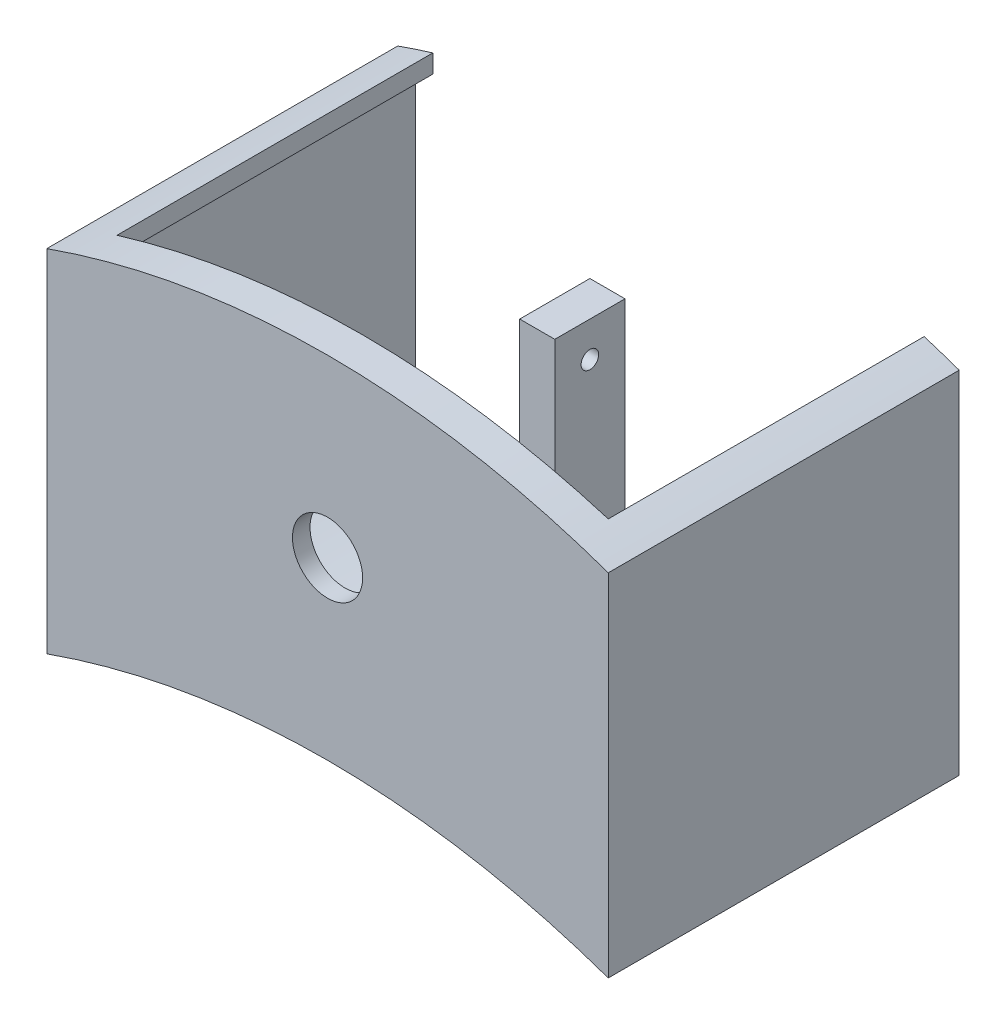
ISO-10303-21;
HEADER;
FILE_DESCRIPTION(('STEP AP214'),'2;1');
FILE_NAME('part.step','',(''),(''),'','','');
FILE_SCHEMA(('AUTOMOTIVE_DESIGN { 1 0 10303 214 1 1 1 1 }'));
ENDSEC;
DATA;
#1=APPLICATION_CONTEXT('core data for automotive mechanical design processes');
#2=APPLICATION_PROTOCOL_DEFINITION('international standard','automotive_design',2000,#1);
#3=PRODUCT_CONTEXT('',#1,'mechanical');
#4=PRODUCT('Part','Part','',(#3));
#5=PRODUCT_RELATED_PRODUCT_CATEGORY('part','',(#4));
#6=PRODUCT_DEFINITION_FORMATION('','',#4);
#7=PRODUCT_DEFINITION_CONTEXT('part definition',#1,'design');
#8=PRODUCT_DEFINITION('design','',#6,#7);
#9=PRODUCT_DEFINITION_SHAPE('','',#8);
#10=(LENGTH_UNIT() NAMED_UNIT(*) SI_UNIT(.MILLI.,.METRE.));
#11=(NAMED_UNIT(*) PLANE_ANGLE_UNIT() SI_UNIT($,.RADIAN.));
#12=(NAMED_UNIT(*) SI_UNIT($,.STERADIAN.) SOLID_ANGLE_UNIT());
#13=UNCERTAINTY_MEASURE_WITH_UNIT(LENGTH_MEASURE(1.E-05),#10,'distance_accuracy_value','');
#14=(GEOMETRIC_REPRESENTATION_CONTEXT(3) GLOBAL_UNCERTAINTY_ASSIGNED_CONTEXT((#13)) GLOBAL_UNIT_ASSIGNED_CONTEXT((#10,
#11,#12)) REPRESENTATION_CONTEXT('',''));
#15=CARTESIAN_POINT('',(0.,0.,0.));
#16=DIRECTION('',(0.,0.,1.));
#17=DIRECTION('',(1.,0.,0.));
#18=AXIS2_PLACEMENT_3D('',#15,#16,#17);
#19=CARTESIAN_POINT('',(25.4,-71.8420489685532,31.75));
#20=DIRECTION('',(0.,0.,-1.));
#21=DIRECTION('',(-1.,0.,0.));
#22=AXIS2_PLACEMENT_3D('',#19,#20,#21);
#23=CYLINDRICAL_SURFACE('',#22,76.2);
#24=DIRECTION('',(0.,0.,-1.));
#25=VECTOR('',#24,1.);
#26=CARTESIAN_POINT('',(50.8,0.,31.75));
#27=LINE('',#26,#25);
#28=CARTESIAN_POINT('',(50.8,0.,31.75));
#29=VERTEX_POINT('',#28);
#30=CARTESIAN_POINT('',(50.8,0.,0.));
#31=VERTEX_POINT('',#30);
#32=EDGE_CURVE('E261',#29,#31,#27,.T.);
#33=ORIENTED_EDGE('',*,*,#32,.F.);
#34=CARTESIAN_POINT('',(25.4,-71.8420489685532,31.75));
#35=DIRECTION('',(0.,0.,-1.));
#36=DIRECTION('',(1.,0.,0.));
#37=AXIS2_PLACEMENT_3D('',#34,#35,#36);
#38=CIRCLE('',#37,76.2);
#39=CARTESIAN_POINT('',(0.,0.,31.75));
#40=VERTEX_POINT('',#39);
#41=EDGE_CURVE('E234',#40,#29,#38,.T.);
#42=ORIENTED_EDGE('',*,*,#41,.F.);
#43=DIRECTION('',(0.,0.,-1.));
#44=VECTOR('',#43,1.);
#45=CARTESIAN_POINT('',(0.,0.,31.75));
#46=LINE('',#45,#44);
#47=CARTESIAN_POINT('',(0.,0.,0.));
#48=VERTEX_POINT('',#47);
#49=EDGE_CURVE('E243',#40,#48,#46,.T.);
#50=ORIENTED_EDGE('',*,*,#49,.T.);
#51=CARTESIAN_POINT('',(25.4,-71.8420489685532,0.));
#52=DIRECTION('',(0.,0.,-1.));
#53=DIRECTION('',(1.,0.,0.));
#54=AXIS2_PLACEMENT_3D('',#51,#52,#53);
#55=CIRCLE('',#54,76.2);
#56=EDGE_CURVE('E233',#48,#31,#55,.T.);
#57=ORIENTED_EDGE('',*,*,#56,.T.);
#58=EDGE_LOOP('',(#33,#42,#50,#57));
#59=FACE_BOUND('',#58,.T.);
#60=ADVANCED_FACE('F32',(#59),#23,.F.);
#61=CARTESIAN_POINT('',(25.4,-71.8420489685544,30.1625));
#62=DIRECTION('',(0.,0.,-1.));
#63=DIRECTION('',(-1.,0.,0.));
#64=AXIS2_PLACEMENT_3D('',#61,#62,#63);
#65=CYLINDRICAL_SURFACE('',#64,77.7875000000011);
#66=CARTESIAN_POINT('',(25.4,-71.8420489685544,0.));
#67=DIRECTION('',(0.,0.,-1.));
#68=DIRECTION('',(1.,0.,0.));
#69=AXIS2_PLACEMENT_3D('',#66,#67,#68);
#70=CIRCLE('',#69,77.7875000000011);
#71=CARTESIAN_POINT('',(1.58750000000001,2.21104009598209,0.));
#72=VERTEX_POINT('',#71);
#73=CARTESIAN_POINT('',(49.2125,2.21104009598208,0.));
#74=VERTEX_POINT('',#73);
#75=EDGE_CURVE('E219',#72,#74,#70,.T.);
#76=ORIENTED_EDGE('',*,*,#75,.F.);
#77=DIRECTION('',(0.,0.,-1.));
#78=VECTOR('',#77,1.);
#79=CARTESIAN_POINT('',(1.58750000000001,2.21104009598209,30.1625));
#80=LINE('',#79,#78);
#81=CARTESIAN_POINT('',(1.58750000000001,2.21104009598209,30.1625));
#82=VERTEX_POINT('',#81);
#83=EDGE_CURVE('E228',#82,#72,#80,.T.);
#84=ORIENTED_EDGE('',*,*,#83,.F.);
#85=CARTESIAN_POINT('',(25.4,-71.8420489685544,30.1625));
#86=DIRECTION('',(0.,0.,-1.));
#87=DIRECTION('',(1.,0.,0.));
#88=AXIS2_PLACEMENT_3D('',#85,#86,#87);
#89=CIRCLE('',#88,77.7875000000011);
#90=CARTESIAN_POINT('',(49.2125,2.21104009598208,30.1625));
#91=VERTEX_POINT('',#90);
#92=EDGE_CURVE('E207',#82,#91,#89,.T.);
#93=ORIENTED_EDGE('',*,*,#92,.T.);
#94=DIRECTION('',(0.,0.,-1.));
#95=VECTOR('',#94,1.);
#96=CARTESIAN_POINT('',(49.2125,2.21104009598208,30.1625));
#97=LINE('',#96,#95);
#98=EDGE_CURVE('E226',#91,#74,#97,.T.);
#99=ORIENTED_EDGE('',*,*,#98,.T.);
#100=EDGE_LOOP('',(#76,#84,#93,#99));
#101=FACE_BOUND('',#100,.T.);
#102=CARTESIAN_POINT('',(25.4,-71.8420489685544,3.175));
#103=DIRECTION('',(0.,0.,1.));
#104=DIRECTION('',(1.,0.,0.));
#105=AXIS2_PLACEMENT_3D('',#102,#103,#104);
#106=CIRCLE('',#105,77.7875000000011);
#107=CARTESIAN_POINT('',(20.5613,5.79481172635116,3.175));
#108=VERTEX_POINT('',#107);
#109=CARTESIAN_POINT('',(23.7363,5.92765759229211,3.175));
#110=VERTEX_POINT('',#109);
#111=EDGE_CURVE('E39',#108,#110,#106,.F.);
#112=ORIENTED_EDGE('',*,*,#111,.T.);
#113=DIRECTION('',(0.,0.,-1.));
#114=VECTOR('',#113,1.);
#115=CARTESIAN_POINT('',(23.7363,5.92765759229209,30.1625));
#116=LINE('',#115,#114);
#117=CARTESIAN_POINT('',(23.7363,5.92765759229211,9.525));
#118=VERTEX_POINT('',#117);
#119=EDGE_CURVE('E12',#110,#118,#116,.F.);
#120=ORIENTED_EDGE('',*,*,#119,.T.);
#121=CARTESIAN_POINT('',(25.4,-71.8420489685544,9.525));
#122=DIRECTION('',(0.,0.,-1.));
#123=DIRECTION('',(-1.,0.,0.));
#124=AXIS2_PLACEMENT_3D('',#121,#122,#123);
#125=CIRCLE('',#124,77.7875000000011);
#126=CARTESIAN_POINT('',(20.5613,5.79481172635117,9.525));
#127=VERTEX_POINT('',#126);
#128=EDGE_CURVE('E272',#118,#127,#125,.F.);
#129=ORIENTED_EDGE('',*,*,#128,.T.);
#130=DIRECTION('',(0.,0.,-1.));
#131=VECTOR('',#130,1.);
#132=CARTESIAN_POINT('',(20.5613,5.79481172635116,30.1625));
#133=LINE('',#132,#131);
#134=EDGE_CURVE('E275',#127,#108,#133,.T.);
#135=ORIENTED_EDGE('',*,*,#134,.T.);
#136=EDGE_LOOP('',(#112,#120,#129,#135));
#137=FACE_BOUND('',#136,.T.);
#138=ADVANCED_FACE('F278',(#101,#137),#65,.T.);
#139=CARTESIAN_POINT('',(25.4,-71.8420489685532,0.));
#140=DIRECTION('',(0.,0.,1.));
#141=DIRECTION('',(1.,0.,0.));
#142=AXIS2_PLACEMENT_3D('',#139,#140,#141);
#143=PLANE('',#142);
#144=CARTESIAN_POINT('',(25.4,-40.0920489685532,0.));
#145=DIRECTION('',(0.,0.,1.));
#146=DIRECTION('',(1.,0.,0.));
#147=AXIS2_PLACEMENT_3D('',#144,#145,#146);
#148=CIRCLE('',#147,76.2);
#149=CARTESIAN_POINT('',(3.175,32.7947768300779,0.));
#150=VERTEX_POINT('',#149);
#151=CARTESIAN_POINT('',(0.,31.75,0.));
#152=VERTEX_POINT('',#151);
#153=EDGE_CURVE('E248',#150,#152,#148,.T.);
#154=ORIENTED_EDGE('',*,*,#153,.F.);
#155=DIRECTION('',(0.,-1.,0.));
#156=VECTOR('',#155,1.);
#157=CARTESIAN_POINT('',(3.175,28.7581986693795,0.));
#158=LINE('',#157,#156);
#159=CARTESIAN_POINT('',(3.175,31.133469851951,0.));
#160=VERTEX_POINT('',#159);
#161=EDGE_CURVE('E170',#150,#160,#158,.T.);
#162=ORIENTED_EDGE('',*,*,#161,.T.);
#163=CARTESIAN_POINT('',(25.4,-40.0920489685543,0.));
#164=DIRECTION('',(0.,0.,1.));
#165=DIRECTION('',(1.,0.,0.));
#166=AXIS2_PLACEMENT_3D('',#163,#164,#165);
#167=CIRCLE('',#166,74.612500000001);
#168=CARTESIAN_POINT('',(1.5875,30.618558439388,0.));
#169=VERTEX_POINT('',#168);
#170=EDGE_CURVE('E216',#160,#169,#167,.T.);
#171=ORIENTED_EDGE('',*,*,#170,.T.);
#172=DIRECTION('',(0.,-1.,0.));
#173=VECTOR('',#172,1.);
#174=CARTESIAN_POINT('',(1.5875,2.21104009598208,0.));
#175=LINE('',#174,#173);
#176=EDGE_CURVE('E215',#169,#72,#175,.T.);
#177=ORIENTED_EDGE('',*,*,#176,.T.);
#178=ORIENTED_EDGE('',*,*,#75,.T.);
#179=DIRECTION('',(0.,1.,0.));
#180=VECTOR('',#179,1.);
#181=CARTESIAN_POINT('',(49.2125,2.21104009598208,0.));
#182=LINE('',#181,#180);
#183=CARTESIAN_POINT('',(49.2125,30.618558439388,0.));
#184=VERTEX_POINT('',#183);
#185=EDGE_CURVE('E205',#74,#184,#182,.T.);
#186=ORIENTED_EDGE('',*,*,#185,.T.);
#187=CARTESIAN_POINT('',(47.625,31.133469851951,0.));
#188=VERTEX_POINT('',#187);
#189=EDGE_CURVE('E212',#184,#188,#167,.T.);
#190=ORIENTED_EDGE('',*,*,#189,.T.);
#191=DIRECTION('',(0.,1.,0.));
#192=VECTOR('',#191,1.);
#193=CARTESIAN_POINT('',(47.625,28.7581986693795,0.));
#194=LINE('',#193,#192);
#195=CARTESIAN_POINT('',(47.625,32.7947768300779,0.));
#196=VERTEX_POINT('',#195);
#197=EDGE_CURVE('E54',#188,#196,#194,.T.);
#198=ORIENTED_EDGE('',*,*,#197,.T.);
#199=CARTESIAN_POINT('',(50.8,31.75,0.));
#200=VERTEX_POINT('',#199);
#201=EDGE_CURVE('E249',#200,#196,#148,.T.);
#202=ORIENTED_EDGE('',*,*,#201,.F.);
#203=DIRECTION('',(0.,1.,0.));
#204=VECTOR('',#203,1.);
#205=CARTESIAN_POINT('',(50.8,0.,0.));
#206=LINE('',#205,#204);
#207=EDGE_CURVE('E246',#31,#200,#206,.T.);
#208=ORIENTED_EDGE('',*,*,#207,.F.);
#209=ORIENTED_EDGE('',*,*,#56,.F.);
#210=DIRECTION('',(0.,-1.,0.));
#211=VECTOR('',#210,1.);
#212=CARTESIAN_POINT('',(0.,0.,0.));
#213=LINE('',#212,#211);
#214=EDGE_CURVE('E237',#152,#48,#213,.T.);
#215=ORIENTED_EDGE('',*,*,#214,.F.);
#216=EDGE_LOOP('',(#154,#162,#171,#177,#178,#186,#190,#198,#202,#208,#209,#215));
#217=FACE_BOUND('',#216,.T.);
#218=ADVANCED_FACE('F301',(#217),#143,.F.);
#219=CARTESIAN_POINT('',(50.8,0.,31.75));
#220=DIRECTION('',(-1.,0.,0.));
#221=DIRECTION('',(0.,0.,1.));
#222=AXIS2_PLACEMENT_3D('',#219,#220,#221);
#223=PLANE('',#222);
#224=ORIENTED_EDGE('',*,*,#207,.T.);
#225=DIRECTION('',(0.,0.,-1.));
#226=VECTOR('',#225,1.);
#227=CARTESIAN_POINT('',(50.8,31.75,31.75));
#228=LINE('',#227,#226);
#229=CARTESIAN_POINT('',(50.8,31.75,31.75));
#230=VERTEX_POINT('',#229);
#231=EDGE_CURVE('E258',#230,#200,#228,.T.);
#232=ORIENTED_EDGE('',*,*,#231,.F.);
#233=DIRECTION('',(0.,1.,0.));
#234=VECTOR('',#233,1.);
#235=CARTESIAN_POINT('',(50.8,0.,31.75));
#236=LINE('',#235,#234);
#237=EDGE_CURVE('E236',#29,#230,#236,.T.);
#238=ORIENTED_EDGE('',*,*,#237,.F.);
#239=ORIENTED_EDGE('',*,*,#32,.T.);
#240=EDGE_LOOP('',(#224,#232,#238,#239));
#241=FACE_BOUND('',#240,.T.);
#242=ADVANCED_FACE('F309',(#241),#223,.F.);
#243=CARTESIAN_POINT('',(25.4,-40.0920489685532,31.75));
#244=DIRECTION('',(0.,0.,-1.));
#245=DIRECTION('',(-1.,0.,0.));
#246=AXIS2_PLACEMENT_3D('',#243,#244,#245);
#247=CYLINDRICAL_SURFACE('',#246,76.2);
#248=CARTESIAN_POINT('',(25.4,-40.0920489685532,28.575));
#249=DIRECTION('',(0.,0.,1.));
#250=DIRECTION('',(1.,0.,0.));
#251=AXIS2_PLACEMENT_3D('',#248,#249,#250);
#252=CIRCLE('',#251,76.2);
#253=CARTESIAN_POINT('',(47.625,32.7947768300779,28.575));
#254=VERTEX_POINT('',#253);
#255=CARTESIAN_POINT('',(3.175,32.7947768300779,28.575));
#256=VERTEX_POINT('',#255);
#257=EDGE_CURVE('E194',#254,#256,#252,.T.);
#258=ORIENTED_EDGE('',*,*,#257,.T.);
#259=DIRECTION('',(0.,0.,-1.));
#260=VECTOR('',#259,1.);
#261=CARTESIAN_POINT('',(3.175,32.7947768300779,31.75));
#262=LINE('',#261,#260);
#263=EDGE_CURVE('E186',#256,#150,#262,.T.);
#264=ORIENTED_EDGE('',*,*,#263,.T.);
#265=ORIENTED_EDGE('',*,*,#153,.T.);
#266=DIRECTION('',(0.,0.,-1.));
#267=VECTOR('',#266,1.);
#268=CARTESIAN_POINT('',(0.,31.75,31.75));
#269=LINE('',#268,#267);
#270=CARTESIAN_POINT('',(0.,31.75,31.75));
#271=VERTEX_POINT('',#270);
#272=EDGE_CURVE('E255',#271,#152,#269,.T.);
#273=ORIENTED_EDGE('',*,*,#272,.F.);
#274=CARTESIAN_POINT('',(25.4,-40.0920489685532,31.75));
#275=DIRECTION('',(0.,0.,1.));
#276=DIRECTION('',(1.,0.,0.));
#277=AXIS2_PLACEMENT_3D('',#274,#275,#276);
#278=CIRCLE('',#277,76.2);
#279=EDGE_CURVE('E239',#230,#271,#278,.T.);
#280=ORIENTED_EDGE('',*,*,#279,.F.);
#281=ORIENTED_EDGE('',*,*,#231,.T.);
#282=ORIENTED_EDGE('',*,*,#201,.T.);
#283=DIRECTION('',(0.,0.,-1.));
#284=VECTOR('',#283,1.);
#285=CARTESIAN_POINT('',(47.625,32.7947768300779,31.75));
#286=LINE('',#285,#284);
#287=EDGE_CURVE('E182',#196,#254,#286,.F.);
#288=ORIENTED_EDGE('',*,*,#287,.T.);
#289=EDGE_LOOP('',(#258,#264,#265,#273,#280,#281,#282,#288));
#290=FACE_BOUND('',#289,.T.);
#291=ADVANCED_FACE('F324',(#290),#247,.T.);
#292=CARTESIAN_POINT('',(0.,0.,31.75));
#293=DIRECTION('',(1.,0.,0.));
#294=DIRECTION('',(0.,0.,-1.));
#295=AXIS2_PLACEMENT_3D('',#292,#293,#294);
#296=PLANE('',#295);
#297=ORIENTED_EDGE('',*,*,#214,.T.);
#298=ORIENTED_EDGE('',*,*,#49,.F.);
#299=DIRECTION('',(0.,-1.,0.));
#300=VECTOR('',#299,1.);
#301=CARTESIAN_POINT('',(0.,0.,31.75));
#302=LINE('',#301,#300);
#303=EDGE_CURVE('E241',#271,#40,#302,.T.);
#304=ORIENTED_EDGE('',*,*,#303,.F.);
#305=ORIENTED_EDGE('',*,*,#272,.T.);
#306=EDGE_LOOP('',(#297,#298,#304,#305));
#307=FACE_BOUND('',#306,.T.);
#308=ADVANCED_FACE('F318',(#307),#296,.F.);
#309=CARTESIAN_POINT('',(25.4,-71.8420489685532,31.75));
#310=DIRECTION('',(0.,0.,1.));
#311=DIRECTION('',(1.,0.,0.));
#312=AXIS2_PLACEMENT_3D('',#309,#310,#311);
#313=PLANE('',#312);
#314=CARTESIAN_POINT('',(25.4,20.2329510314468,31.75));
#315=DIRECTION('',(0.,0.,1.));
#316=DIRECTION('',(1.,0.,0.));
#317=AXIS2_PLACEMENT_3D('',#314,#315,#316);
#318=CIRCLE('',#317,3.175);
#319=CARTESIAN_POINT('',(28.575,20.2329510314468,31.75));
#320=VERTEX_POINT('',#319);
#321=EDGE_CURVE('E197',#320,#320,#318,.T.);
#322=ORIENTED_EDGE('',*,*,#321,.F.);
#323=EDGE_LOOP('',(#322));
#324=FACE_BOUND('',#323,.T.);
#325=ORIENTED_EDGE('',*,*,#41,.T.);
#326=ORIENTED_EDGE('',*,*,#237,.T.);
#327=ORIENTED_EDGE('',*,*,#279,.T.);
#328=ORIENTED_EDGE('',*,*,#303,.T.);
#329=EDGE_LOOP('',(#325,#326,#327,#328));
#330=FACE_BOUND('',#329,.T.);
#331=ADVANCED_FACE('F313',(#324,#330),#313,.T.);
#332=CARTESIAN_POINT('',(25.4,-40.0920489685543,30.1625));
#333=DIRECTION('',(0.,0.,-1.));
#334=DIRECTION('',(-1.,0.,0.));
#335=AXIS2_PLACEMENT_3D('',#332,#333,#334);
#336=CYLINDRICAL_SURFACE('',#335,74.612500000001);
#337=DIRECTION('',(0.,0.,-1.));
#338=VECTOR('',#337,1.);
#339=CARTESIAN_POINT('',(3.175,31.133469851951,30.1625));
#340=LINE('',#339,#338);
#341=CARTESIAN_POINT('',(3.175,31.133469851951,28.575));
#342=VERTEX_POINT('',#341);
#343=EDGE_CURVE('E270',#342,#160,#340,.T.);
#344=ORIENTED_EDGE('',*,*,#343,.F.);
#345=CARTESIAN_POINT('',(25.4,-40.0920489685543,28.575));
#346=DIRECTION('',(0.,0.,1.));
#347=DIRECTION('',(1.,0.,0.));
#348=AXIS2_PLACEMENT_3D('',#345,#346,#347);
#349=CIRCLE('',#348,74.612500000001);
#350=CARTESIAN_POINT('',(47.625,31.1334698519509,28.575));
#351=VERTEX_POINT('',#350);
#352=EDGE_CURVE('E268',#351,#342,#349,.T.);
#353=ORIENTED_EDGE('',*,*,#352,.F.);
#354=DIRECTION('',(0.,0.,-1.));
#355=VECTOR('',#354,1.);
#356=CARTESIAN_POINT('',(47.625,31.1334698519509,30.1625));
#357=LINE('',#356,#355);
#358=EDGE_CURVE('E264',#188,#351,#357,.F.);
#359=ORIENTED_EDGE('',*,*,#358,.F.);
#360=ORIENTED_EDGE('',*,*,#189,.F.);
#361=DIRECTION('',(0.,0.,-1.));
#362=VECTOR('',#361,1.);
#363=CARTESIAN_POINT('',(49.2125,30.618558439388,30.1625));
#364=LINE('',#363,#362);
#365=CARTESIAN_POINT('',(49.2125,30.618558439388,30.1625));
#366=VERTEX_POINT('',#365);
#367=EDGE_CURVE('E211',#366,#184,#364,.T.);
#368=ORIENTED_EDGE('',*,*,#367,.F.);
#369=CARTESIAN_POINT('',(25.4,-40.0920489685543,30.1625));
#370=DIRECTION('',(0.,0.,1.));
#371=DIRECTION('',(1.,0.,0.));
#372=AXIS2_PLACEMENT_3D('',#369,#370,#371);
#373=CIRCLE('',#372,74.612500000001);
#374=CARTESIAN_POINT('',(1.5875,30.618558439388,30.1625));
#375=VERTEX_POINT('',#374);
#376=EDGE_CURVE('E201',#366,#375,#373,.T.);
#377=ORIENTED_EDGE('',*,*,#376,.T.);
#378=DIRECTION('',(0.,0.,-1.));
#379=VECTOR('',#378,1.);
#380=CARTESIAN_POINT('',(1.5875,30.618558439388,30.1625));
#381=LINE('',#380,#379);
#382=EDGE_CURVE('E230',#375,#169,#381,.T.);
#383=ORIENTED_EDGE('',*,*,#382,.T.);
#384=ORIENTED_EDGE('',*,*,#170,.F.);
#385=EDGE_LOOP('',(#344,#353,#359,#360,#368,#377,#383,#384));
#386=FACE_BOUND('',#385,.T.);
#387=ADVANCED_FACE('F330',(#386),#336,.F.);
#388=CARTESIAN_POINT('',(1.5875,2.21104009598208,30.1625));
#389=DIRECTION('',(1.,0.,0.));
#390=DIRECTION('',(0.,0.,-1.));
#391=AXIS2_PLACEMENT_3D('',#388,#389,#390);
#392=PLANE('',#391);
#393=ORIENTED_EDGE('',*,*,#176,.F.);
#394=ORIENTED_EDGE('',*,*,#382,.F.);
#395=DIRECTION('',(0.,-1.,0.));
#396=VECTOR('',#395,1.);
#397=CARTESIAN_POINT('',(1.5875,2.21104009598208,30.1625));
#398=LINE('',#397,#396);
#399=EDGE_CURVE('E204',#375,#82,#398,.T.);
#400=ORIENTED_EDGE('',*,*,#399,.T.);
#401=ORIENTED_EDGE('',*,*,#83,.T.);
#402=EDGE_LOOP('',(#393,#394,#400,#401));
#403=FACE_BOUND('',#402,.T.);
#404=ADVANCED_FACE('F336',(#403),#392,.T.);
#405=CARTESIAN_POINT('',(49.2125,2.21104009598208,30.1625));
#406=DIRECTION('',(-1.,0.,0.));
#407=DIRECTION('',(0.,0.,1.));
#408=AXIS2_PLACEMENT_3D('',#405,#406,#407);
#409=PLANE('',#408);
#410=ORIENTED_EDGE('',*,*,#185,.F.);
#411=ORIENTED_EDGE('',*,*,#98,.F.);
#412=DIRECTION('',(0.,1.,0.));
#413=VECTOR('',#412,1.);
#414=CARTESIAN_POINT('',(49.2125,2.21104009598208,30.1625));
#415=LINE('',#414,#413);
#416=EDGE_CURVE('E209',#91,#366,#415,.T.);
#417=ORIENTED_EDGE('',*,*,#416,.T.);
#418=ORIENTED_EDGE('',*,*,#367,.T.);
#419=EDGE_LOOP('',(#410,#411,#417,#418));
#420=FACE_BOUND('',#419,.T.);
#421=ADVANCED_FACE('F344',(#420),#409,.T.);
#422=CARTESIAN_POINT('',(25.4,-40.0920489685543,30.1625));
#423=DIRECTION('',(0.,0.,1.));
#424=DIRECTION('',(1.,0.,0.));
#425=AXIS2_PLACEMENT_3D('',#422,#423,#424);
#426=PLANE('',#425);
#427=CARTESIAN_POINT('',(25.4,20.2329510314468,30.1625));
#428=DIRECTION('',(0.,0.,1.));
#429=DIRECTION('',(1.,0.,0.));
#430=AXIS2_PLACEMENT_3D('',#427,#428,#429);
#431=CIRCLE('',#430,3.175);
#432=CARTESIAN_POINT('',(28.575,20.2329510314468,30.1625));
#433=VERTEX_POINT('',#432);
#434=EDGE_CURVE('E200',#433,#433,#431,.T.);
#435=ORIENTED_EDGE('',*,*,#434,.T.);
#436=EDGE_LOOP('',(#435));
#437=FACE_BOUND('',#436,.T.);
#438=ORIENTED_EDGE('',*,*,#376,.F.);
#439=ORIENTED_EDGE('',*,*,#416,.F.);
#440=ORIENTED_EDGE('',*,*,#92,.F.);
#441=ORIENTED_EDGE('',*,*,#399,.F.);
#442=EDGE_LOOP('',(#438,#439,#440,#441));
#443=FACE_BOUND('',#442,.T.);
#444=ADVANCED_FACE('F346',(#437,#443),#426,.F.);
#445=CARTESIAN_POINT('',(25.4,20.2329510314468,0.));
#446=DIRECTION('',(0.,0.,1.));
#447=DIRECTION('',(1.,0.,0.));
#448=AXIS2_PLACEMENT_3D('',#445,#446,#447);
#449=CYLINDRICAL_SURFACE('',#448,3.175);
#450=ORIENTED_EDGE('',*,*,#321,.T.);
#451=EDGE_LOOP('',(#450));
#452=FACE_BOUND('',#451,.T.);
#453=ORIENTED_EDGE('',*,*,#434,.F.);
#454=EDGE_LOOP('',(#453));
#455=FACE_BOUND('',#454,.T.);
#456=ADVANCED_FACE('F348',(#452,#455),#449,.F.);
#457=CARTESIAN_POINT('',(25.4,-13.3752701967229,28.575));
#458=DIRECTION('',(0.,0.,1.));
#459=DIRECTION('',(1.,0.,0.));
#460=AXIS2_PLACEMENT_3D('',#457,#458,#459);
#461=PLANE('',#460);
#462=DIRECTION('',(0.,1.,0.));
#463=VECTOR('',#462,1.);
#464=CARTESIAN_POINT('',(47.625,28.7581986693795,28.575));
#465=LINE('',#464,#463);
#466=EDGE_CURVE('E183',#351,#254,#465,.T.);
#467=ORIENTED_EDGE('',*,*,#466,.F.);
#468=ORIENTED_EDGE('',*,*,#352,.T.);
#469=DIRECTION('',(0.,-1.,0.));
#470=VECTOR('',#469,1.);
#471=CARTESIAN_POINT('',(3.175,28.7581986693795,28.575));
#472=LINE('',#471,#470);
#473=EDGE_CURVE('E167',#256,#342,#472,.T.);
#474=ORIENTED_EDGE('',*,*,#473,.F.);
#475=ORIENTED_EDGE('',*,*,#257,.F.);
#476=EDGE_LOOP('',(#467,#468,#474,#475));
#477=FACE_BOUND('',#476,.T.);
#478=ADVANCED_FACE('F355',(#477),#461,.F.);
#479=CARTESIAN_POINT('',(3.175,28.7581986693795,0.));
#480=DIRECTION('',(-1.,0.,0.));
#481=DIRECTION('',(0.,0.,1.));
#482=AXIS2_PLACEMENT_3D('',#479,#480,#481);
#483=PLANE('',#482);
#484=ORIENTED_EDGE('',*,*,#473,.T.);
#485=ORIENTED_EDGE('',*,*,#343,.T.);
#486=ORIENTED_EDGE('',*,*,#161,.F.);
#487=ORIENTED_EDGE('',*,*,#263,.F.);
#488=EDGE_LOOP('',(#484,#485,#486,#487));
#489=FACE_BOUND('',#488,.T.);
#490=ADVANCED_FACE('F438',(#489),#483,.F.);
#491=CARTESIAN_POINT('',(47.625,28.7581986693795,0.));
#492=DIRECTION('',(1.,0.,0.));
#493=DIRECTION('',(0.,0.,-1.));
#494=AXIS2_PLACEMENT_3D('',#491,#492,#493);
#495=PLANE('',#494);
#496=ORIENTED_EDGE('',*,*,#197,.F.);
#497=ORIENTED_EDGE('',*,*,#358,.T.);
#498=ORIENTED_EDGE('',*,*,#466,.T.);
#499=ORIENTED_EDGE('',*,*,#287,.F.);
#500=EDGE_LOOP('',(#496,#497,#498,#499));
#501=FACE_BOUND('',#500,.T.);
#502=ADVANCED_FACE('F294',(#501),#495,.F.);
#503=CARTESIAN_POINT('',(23.7363,25.4,9.525));
#504=DIRECTION('',(0.,1.,0.));
#505=DIRECTION('',(0.,0.,1.));
#506=AXIS2_PLACEMENT_3D('',#503,#504,#505);
#507=PLANE('',#506);
#508=DIRECTION('',(0.,0.,-1.));
#509=VECTOR('',#508,1.);
#510=CARTESIAN_POINT('',(23.7363,25.4,3.175));
#511=LINE('',#510,#509);
#512=CARTESIAN_POINT('',(23.7363,25.4,9.525));
#513=VERTEX_POINT('',#512);
#514=CARTESIAN_POINT('',(23.7363,25.4,3.175));
#515=VERTEX_POINT('',#514);
#516=EDGE_CURVE('E156',#513,#515,#511,.T.);
#517=ORIENTED_EDGE('',*,*,#516,.T.);
#518=DIRECTION('',(-1.,0.,0.));
#519=VECTOR('',#518,1.);
#520=CARTESIAN_POINT('',(20.5613,25.4,3.175));
#521=LINE('',#520,#519);
#522=CARTESIAN_POINT('',(20.5613,25.4,3.175));
#523=VERTEX_POINT('',#522);
#524=EDGE_CURVE('E145',#515,#523,#521,.T.);
#525=ORIENTED_EDGE('',*,*,#524,.T.);
#526=DIRECTION('',(0.,0.,1.));
#527=VECTOR('',#526,1.);
#528=CARTESIAN_POINT('',(20.5613,25.4,3.175));
#529=LINE('',#528,#527);
#530=CARTESIAN_POINT('',(20.5613,25.4,9.525));
#531=VERTEX_POINT('',#530);
#532=EDGE_CURVE('E155',#523,#531,#529,.T.);
#533=ORIENTED_EDGE('',*,*,#532,.T.);
#534=DIRECTION('',(1.,0.,0.));
#535=VECTOR('',#534,1.);
#536=CARTESIAN_POINT('',(20.5613,25.4,9.525));
#537=LINE('',#536,#535);
#538=EDGE_CURVE('E160',#531,#513,#537,.T.);
#539=ORIENTED_EDGE('',*,*,#538,.T.);
#540=EDGE_LOOP('',(#517,#525,#533,#539));
#541=FACE_BOUND('',#540,.T.);
#542=ADVANCED_FACE('F159',(#541),#507,.T.);
#543=CARTESIAN_POINT('',(20.5613,25.4,9.525));
#544=DIRECTION('',(0.,0.,-1.));
#545=DIRECTION('',(-1.,0.,0.));
#546=AXIS2_PLACEMENT_3D('',#543,#544,#545);
#547=PLANE('',#546);
#548=ORIENTED_EDGE('',*,*,#128,.F.);
#549=DIRECTION('',(0.,-1.,0.));
#550=VECTOR('',#549,1.);
#551=CARTESIAN_POINT('',(23.7363,25.4,9.525));
#552=LINE('',#551,#550);
#553=EDGE_CURVE('E282',#513,#118,#552,.T.);
#554=ORIENTED_EDGE('',*,*,#553,.F.);
#555=ORIENTED_EDGE('',*,*,#538,.F.);
#556=DIRECTION('',(0.,-1.,0.));
#557=VECTOR('',#556,1.);
#558=CARTESIAN_POINT('',(20.5613,25.4,9.525));
#559=LINE('',#558,#557);
#560=EDGE_CURVE('E46',#531,#127,#559,.T.);
#561=ORIENTED_EDGE('',*,*,#560,.T.);
#562=EDGE_LOOP('',(#548,#554,#555,#561));
#563=FACE_BOUND('',#562,.T.);
#564=ADVANCED_FACE('F285',(#563),#547,.F.);
#565=CARTESIAN_POINT('',(20.5613,25.4,3.175));
#566=DIRECTION('',(1.,0.,0.));
#567=DIRECTION('',(0.,0.,-1.));
#568=AXIS2_PLACEMENT_3D('',#565,#566,#567);
#569=PLANE('',#568);
#570=CARTESIAN_POINT('',(20.5613,22.225,6.35));
#571=DIRECTION('',(1.,0.,0.));
#572=DIRECTION('',(0.,0.,-1.));
#573=AXIS2_PLACEMENT_3D('',#570,#571,#572);
#574=CIRCLE('',#573,0.793749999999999);
#575=CARTESIAN_POINT('',(20.5613,22.225,5.55625));
#576=VERTEX_POINT('',#575);
#577=EDGE_CURVE('E164',#576,#576,#574,.F.);
#578=ORIENTED_EDGE('',*,*,#577,.F.);
#579=EDGE_LOOP('',(#578));
#580=FACE_BOUND('',#579,.T.);
#581=ORIENTED_EDGE('',*,*,#134,.F.);
#582=ORIENTED_EDGE('',*,*,#560,.F.);
#583=ORIENTED_EDGE('',*,*,#532,.F.);
#584=DIRECTION('',(0.,-1.,0.));
#585=VECTOR('',#584,1.);
#586=CARTESIAN_POINT('',(20.5613,25.4,3.175));
#587=LINE('',#586,#585);
#588=EDGE_CURVE('E152',#523,#108,#587,.T.);
#589=ORIENTED_EDGE('',*,*,#588,.T.);
#590=EDGE_LOOP('',(#581,#582,#583,#589));
#591=FACE_BOUND('',#590,.T.);
#592=ADVANCED_FACE('F280',(#580,#591),#569,.F.);
#593=CARTESIAN_POINT('',(20.5613,25.4,3.175));
#594=DIRECTION('',(0.,0.,1.));
#595=DIRECTION('',(1.,0.,0.));
#596=AXIS2_PLACEMENT_3D('',#593,#594,#595);
#597=PLANE('',#596);
#598=ORIENTED_EDGE('',*,*,#111,.F.);
#599=ORIENTED_EDGE('',*,*,#588,.F.);
#600=ORIENTED_EDGE('',*,*,#524,.F.);
#601=DIRECTION('',(0.,-1.,0.));
#602=VECTOR('',#601,1.);
#603=CARTESIAN_POINT('',(23.7363,25.4,3.175));
#604=LINE('',#603,#602);
#605=EDGE_CURVE('E149',#515,#110,#604,.T.);
#606=ORIENTED_EDGE('',*,*,#605,.T.);
#607=EDGE_LOOP('',(#598,#599,#600,#606));
#608=FACE_BOUND('',#607,.T.);
#609=ADVANCED_FACE('F147',(#608),#597,.F.);
#610=CARTESIAN_POINT('',(23.7363,25.4,3.175));
#611=DIRECTION('',(-1.,0.,0.));
#612=DIRECTION('',(0.,0.,1.));
#613=AXIS2_PLACEMENT_3D('',#610,#611,#612);
#614=PLANE('',#613);
#615=CARTESIAN_POINT('',(23.7363,22.225,6.35));
#616=DIRECTION('',(1.,0.,0.));
#617=DIRECTION('',(0.,0.,-1.));
#618=AXIS2_PLACEMENT_3D('',#615,#616,#617);
#619=CIRCLE('',#618,0.793749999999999);
#620=CARTESIAN_POINT('',(23.7363,22.225,5.55625));
#621=VERTEX_POINT('',#620);
#622=EDGE_CURVE('E506',#621,#621,#619,.T.);
#623=ORIENTED_EDGE('',*,*,#622,.F.);
#624=EDGE_LOOP('',(#623));
#625=FACE_BOUND('',#624,.T.);
#626=ORIENTED_EDGE('',*,*,#119,.F.);
#627=ORIENTED_EDGE('',*,*,#605,.F.);
#628=ORIENTED_EDGE('',*,*,#516,.F.);
#629=ORIENTED_EDGE('',*,*,#553,.T.);
#630=EDGE_LOOP('',(#626,#627,#628,#629));
#631=FACE_BOUND('',#630,.T.);
#632=ADVANCED_FACE('F166',(#625,#631),#614,.F.);
#633=CARTESIAN_POINT('',(-0.00100000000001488,22.225,6.35000000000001));
#634=DIRECTION('',(1.,0.,0.));
#635=DIRECTION('',(0.,0.,-1.));
#636=AXIS2_PLACEMENT_3D('',#633,#634,#635);
#637=CYLINDRICAL_SURFACE('',#636,0.793749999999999);
#638=ORIENTED_EDGE('',*,*,#622,.T.);
#639=EDGE_LOOP('',(#638));
#640=FACE_BOUND('',#639,.T.);
#641=ORIENTED_EDGE('',*,*,#577,.T.);
#642=EDGE_LOOP('',(#641));
#643=FACE_BOUND('',#642,.T.);
#644=ADVANCED_FACE('F487',(#640,#643),#637,.F.);
#645=CLOSED_SHELL('',(#60,#138,#218,#242,#291,#308,#331,#387,#404,#421,#444,#456,#478,#490,#502,
#542,#564,#592,#609,#632,#644));
#646=MANIFOLD_SOLID_BREP('B2',#645);
#647=ADVANCED_BREP_SHAPE_REPRESENTATION('',(#18,#646),#14);
#648=SHAPE_DEFINITION_REPRESENTATION(#9,#647);
ENDSEC;
END-ISO-10303-21;
